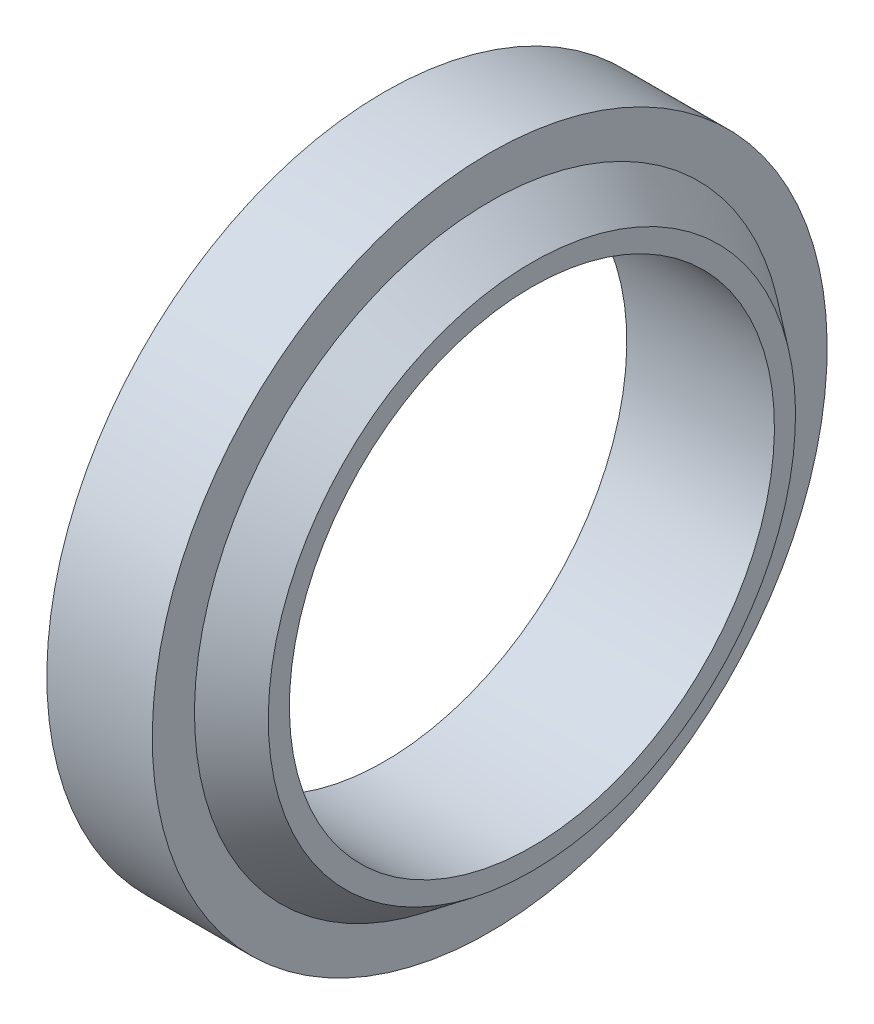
ISO-10303-21;
HEADER;
FILE_DESCRIPTION(('STEP AP214'),'2;1');
FILE_NAME('part.step','',(''),(''),'','','');
FILE_SCHEMA(('AUTOMOTIVE_DESIGN { 1 0 10303 214 1 1 1 1 }'));
ENDSEC;
DATA;
#1=APPLICATION_CONTEXT('core data for automotive mechanical design processes');
#2=APPLICATION_PROTOCOL_DEFINITION('international standard','automotive_design',2000,#1);
#3=PRODUCT_CONTEXT('',#1,'mechanical');
#4=PRODUCT('Part','Part','',(#3));
#5=PRODUCT_RELATED_PRODUCT_CATEGORY('part','',(#4));
#6=PRODUCT_DEFINITION_FORMATION('','',#4);
#7=PRODUCT_DEFINITION_CONTEXT('part definition',#1,'design');
#8=PRODUCT_DEFINITION('design','',#6,#7);
#9=PRODUCT_DEFINITION_SHAPE('','',#8);
#10=(LENGTH_UNIT() NAMED_UNIT(*) SI_UNIT(.MILLI.,.METRE.));
#11=(NAMED_UNIT(*) PLANE_ANGLE_UNIT() SI_UNIT($,.RADIAN.));
#12=(NAMED_UNIT(*) SI_UNIT($,.STERADIAN.) SOLID_ANGLE_UNIT());
#13=UNCERTAINTY_MEASURE_WITH_UNIT(LENGTH_MEASURE(1.E-05),#10,'distance_accuracy_value','');
#14=(GEOMETRIC_REPRESENTATION_CONTEXT(3) GLOBAL_UNCERTAINTY_ASSIGNED_CONTEXT((#13)) GLOBAL_UNIT_ASSIGNED_CONTEXT((#10,
#11,#12)) REPRESENTATION_CONTEXT('',''));
#15=CARTESIAN_POINT('',(0.,0.,0.));
#16=DIRECTION('',(0.,0.,1.));
#17=DIRECTION('',(1.,0.,0.));
#18=AXIS2_PLACEMENT_3D('',#15,#16,#17);
#19=CARTESIAN_POINT('',(5.00000000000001,0.,0.));
#20=DIRECTION('',(-1.,0.,0.));
#21=DIRECTION('',(0.,-1.,0.));
#22=AXIS2_PLACEMENT_3D('',#19,#20,#21);
#23=CONICAL_SURFACE('',#22,14.,0.643501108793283);
#24=CARTESIAN_POINT('',(7.00000000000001,0.,0.));
#25=DIRECTION('',(-1.,0.,0.));
#26=DIRECTION('',(0.,-1.,0.));
#27=AXIS2_PLACEMENT_3D('',#24,#25,#26);
#28=CIRCLE('',#27,12.5);
#29=CARTESIAN_POINT('',(7.00000000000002,-12.5,0.));
#30=VERTEX_POINT('',#29);
#31=EDGE_CURVE('E34',#30,#30,#28,.F.);
#32=ORIENTED_EDGE('',*,*,#31,.F.);
#33=EDGE_LOOP('',(#32));
#34=FACE_BOUND('',#33,.T.);
#35=CARTESIAN_POINT('',(5.00000000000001,0.,0.));
#36=DIRECTION('',(-1.,0.,0.));
#37=DIRECTION('',(0.,-1.,0.));
#38=AXIS2_PLACEMENT_3D('',#35,#36,#37);
#39=CIRCLE('',#38,14.);
#40=CARTESIAN_POINT('',(5.00000000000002,-14.,0.));
#41=VERTEX_POINT('',#40);
#42=EDGE_CURVE('E18',#41,#41,#39,.T.);
#43=ORIENTED_EDGE('',*,*,#42,.F.);
#44=EDGE_LOOP('',(#43));
#45=FACE_BOUND('',#44,.T.);
#46=ADVANCED_FACE('F14',(#34,#45),#23,.T.);
#47=CARTESIAN_POINT('',(5.,15.,0.));
#48=DIRECTION('',(1.,0.,0.));
#49=DIRECTION('',(0.,0.,-1.));
#50=AXIS2_PLACEMENT_3D('',#47,#48,#49);
#51=PLANE('',#50);
#52=CARTESIAN_POINT('',(5.00000000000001,0.,0.));
#53=DIRECTION('',(1.,0.,0.));
#54=DIRECTION('',(0.,1.,0.));
#55=AXIS2_PLACEMENT_3D('',#52,#53,#54);
#56=CIRCLE('',#55,16.);
#57=CARTESIAN_POINT('',(5.,16.,0.));
#58=VERTEX_POINT('',#57);
#59=EDGE_CURVE('E32',#58,#58,#56,.F.);
#60=ORIENTED_EDGE('',*,*,#59,.F.);
#61=EDGE_LOOP('',(#60));
#62=FACE_BOUND('',#61,.T.);
#63=ORIENTED_EDGE('',*,*,#42,.T.);
#64=EDGE_LOOP('',(#63));
#65=FACE_BOUND('',#64,.T.);
#66=ADVANCED_FACE('F41',(#62,#65),#51,.T.);
#67=CARTESIAN_POINT('',(7.,12.,0.));
#68=DIRECTION('',(1.,0.,0.));
#69=DIRECTION('',(0.,0.,-1.));
#70=AXIS2_PLACEMENT_3D('',#67,#68,#69);
#71=PLANE('',#70);
#72=ORIENTED_EDGE('',*,*,#31,.T.);
#73=EDGE_LOOP('',(#72));
#74=FACE_BOUND('',#73,.T.);
#75=CARTESIAN_POINT('',(7.00000000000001,0.,0.));
#76=DIRECTION('',(1.,0.,0.));
#77=DIRECTION('',(0.,1.,0.));
#78=AXIS2_PLACEMENT_3D('',#75,#76,#77);
#79=CIRCLE('',#78,11.5);
#80=CARTESIAN_POINT('',(7.,11.5,0.));
#81=VERTEX_POINT('',#80);
#82=EDGE_CURVE('E27',#81,#81,#79,.T.);
#83=ORIENTED_EDGE('',*,*,#82,.F.);
#84=EDGE_LOOP('',(#83));
#85=FACE_BOUND('',#84,.T.);
#86=ADVANCED_FACE('F49',(#74,#85),#71,.T.);
#87=CARTESIAN_POINT('',(2.50000000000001,0.,0.));
#88=DIRECTION('',(1.,0.,0.));
#89=DIRECTION('',(0.,1.,0.));
#90=AXIS2_PLACEMENT_3D('',#87,#88,#89);
#91=CYLINDRICAL_SURFACE('',#90,16.);
#92=ORIENTED_EDGE('',*,*,#59,.T.);
#93=EDGE_LOOP('',(#92));
#94=FACE_BOUND('',#93,.T.);
#95=CARTESIAN_POINT('',(0.,0.,0.));
#96=DIRECTION('',(1.,0.,0.));
#97=DIRECTION('',(0.,1.,0.));
#98=AXIS2_PLACEMENT_3D('',#95,#96,#97);
#99=CIRCLE('',#98,16.);
#100=CARTESIAN_POINT('',(0.,16.,0.));
#101=VERTEX_POINT('',#100);
#102=EDGE_CURVE('E22',#101,#101,#99,.F.);
#103=ORIENTED_EDGE('',*,*,#102,.F.);
#104=EDGE_LOOP('',(#103));
#105=FACE_BOUND('',#104,.T.);
#106=ADVANCED_FACE('F56',(#94,#105),#91,.T.);
#107=CARTESIAN_POINT('',(0.,0.,0.));
#108=DIRECTION('',(1.,0.,0.));
#109=DIRECTION('',(0.,1.,0.));
#110=AXIS2_PLACEMENT_3D('',#107,#108,#109);
#111=CYLINDRICAL_SURFACE('',#110,11.5);
#112=CARTESIAN_POINT('',(0.,0.,0.));
#113=DIRECTION('',(1.,0.,0.));
#114=DIRECTION('',(0.,1.,0.));
#115=AXIS2_PLACEMENT_3D('',#112,#113,#114);
#116=CIRCLE('',#115,11.5);
#117=CARTESIAN_POINT('',(0.,11.5,0.));
#118=VERTEX_POINT('',#117);
#119=EDGE_CURVE('E9',#118,#118,#116,.T.);
#120=ORIENTED_EDGE('',*,*,#119,.F.);
#121=EDGE_LOOP('',(#120));
#122=FACE_BOUND('',#121,.T.);
#123=ORIENTED_EDGE('',*,*,#82,.T.);
#124=EDGE_LOOP('',(#123));
#125=FACE_BOUND('',#124,.T.);
#126=ADVANCED_FACE('F53',(#122,#125),#111,.F.);
#127=CARTESIAN_POINT('',(0.,13.75,0.));
#128=DIRECTION('',(-1.,0.,0.));
#129=DIRECTION('',(0.,-1.,0.));
#130=AXIS2_PLACEMENT_3D('',#127,#128,#129);
#131=PLANE('',#130);
#132=ORIENTED_EDGE('',*,*,#119,.T.);
#133=EDGE_LOOP('',(#132));
#134=FACE_BOUND('',#133,.T.);
#135=ORIENTED_EDGE('',*,*,#102,.T.);
#136=EDGE_LOOP('',(#135));
#137=FACE_BOUND('',#136,.T.);
#138=ADVANCED_FACE('F16',(#134,#137),#131,.T.);
#139=CLOSED_SHELL('',(#46,#66,#86,#106,#126,#138));
#140=MANIFOLD_SOLID_BREP('B1',#139);
#141=ADVANCED_BREP_SHAPE_REPRESENTATION('',(#18,#140),#14);
#142=SHAPE_DEFINITION_REPRESENTATION(#9,#141);
ENDSEC;
END-ISO-10303-21;
